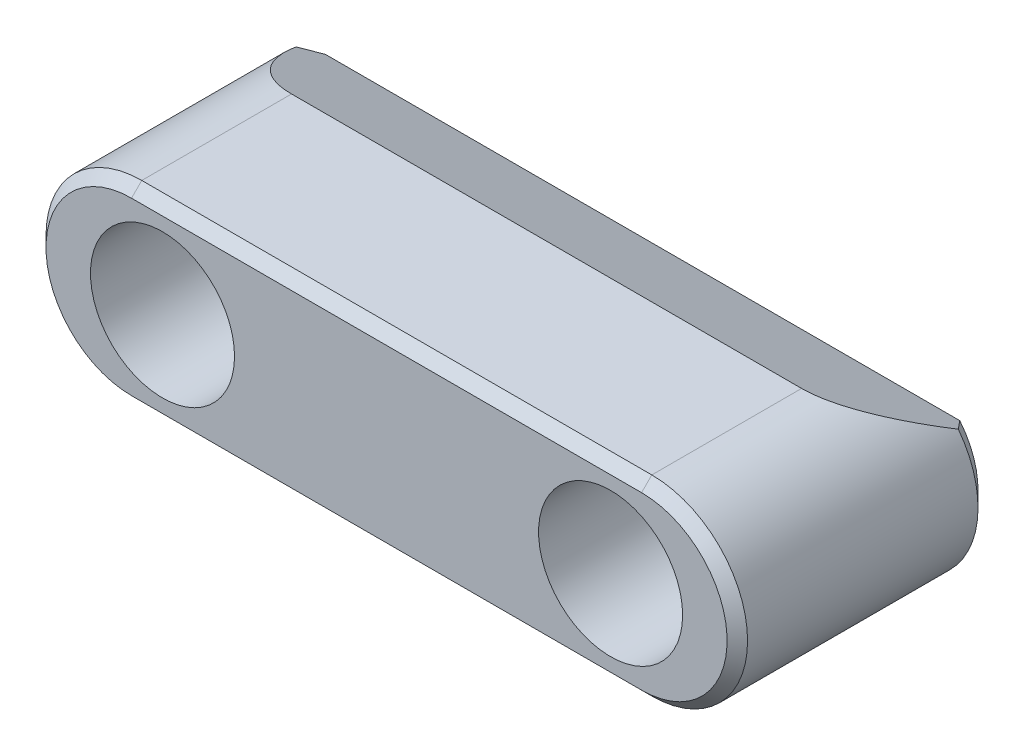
from build123d import *

# Parameters (mm, degrees)
BOSS_EXTRUDE2_DEPTH                            = 12.7
CBORE_FOR_6_SOCKET_HEAD_CAP_SCREW2_D           = 4.3053
CBORE_FOR_6_SOCKET_HEAD_CAP_SCREW2_CBORE_D     = 7.14502
CBORE_FOR_6_SOCKET_HEAD_CAP_SCREW2_CBORE_DEPTH = 5.08
CUT_EXTRUDE1_DEPTH                             = 23.058463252
CUT_EXTRUDE1_DEPTH_BACK                        = 23.058463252
CHAMFER1_SIZE                                  = 0.508
CHAMFER2_SIZE                                  = 0.762


with BuildPart() as part:
    # Sketch2 → Boss-Extrude2 (new body)
    with BuildSketch(Plane.XY):
        with BuildLine():
            Line((-12.6492, 4.7498), (12.6492, 4.7498))
            ThreePointArc((12.6492, 4.7498), (17.399, 0), (12.6492, -4.7498))
            Line((12.6492, -4.7498), (-12.6492, -4.7498))
            ThreePointArc((-12.6492, -4.7498), (-17.399, 0), (-12.6492, 4.7498))
        make_face()
    extrude(amount=-BOSS_EXTRUDE2_DEPTH)

    # CBORE for _6 Socket Head Cap Screw2 (through all)
    with Locations(Plane.XY):
        with Locations((-11.1125, 0), (11.1125, 0)):
            CounterBoreHole(CBORE_FOR_6_SOCKET_HEAD_CAP_SCREW2_D / 2, CBORE_FOR_6_SOCKET_HEAD_CAP_SCREW2_CBORE_D / 2, CBORE_FOR_6_SOCKET_HEAD_CAP_SCREW2_CBORE_DEPTH)

    # Sketch9 → Cut-Extrude1 (cut, two sides: drawn at the far end of the back side and taken through both)
    with BuildSketch(Plane(origin=(0, 0, 0), x_dir=(0, 0, -1), z_dir=(1, 0, 0)).offset(-CUT_EXTRUDE1_DEPTH_BACK)):
        Polygon((12.7, 4.7498), (7.9375, 4.7498), (12.7, 2.529009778), align=None)
    extrude(amount=CUT_EXTRUDE1_DEPTH + CUT_EXTRUDE1_DEPTH_BACK, mode=Mode.SUBTRACT)

    # Chamfer1
    chamfer1_edges = [part.edges().sort_by_distance(p)[0] for p in [
        (0, 4.7498, 0),
        (17.399, 0, 0),
        (0, -4.7498, 0),
        (-17.399, 0, 0),
    ]]
    chamfer(chamfer1_edges, length=CHAMFER1_SIZE)

    # Chamfer2
    chamfer2_edges = [part.edges().sort_by_distance(p)[0] for p in [
        (-16.80689712, -2.296552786, -12.7),
        (16.80689712, -2.296552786, -12.7),
        (0, -4.7498, -12.7),
    ]]
    chamfer(chamfer2_edges, length=CHAMFER2_SIZE)


solid = part.part
